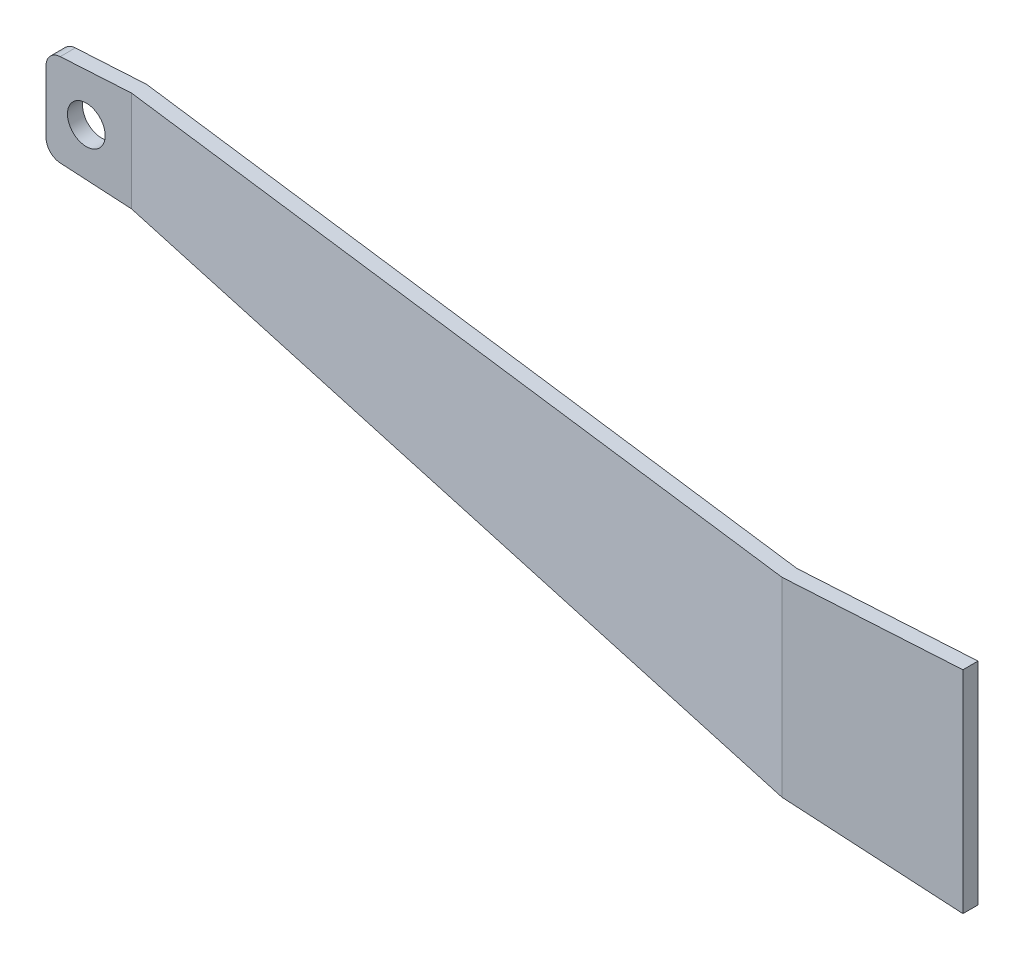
ISO-10303-21;
HEADER;
FILE_DESCRIPTION(('STEP AP214'),'2;1');
FILE_NAME('part.step','',(''),(''),'','','');
FILE_SCHEMA(('AUTOMOTIVE_DESIGN { 1 0 10303 214 1 1 1 1 }'));
ENDSEC;
DATA;
#1=APPLICATION_CONTEXT('core data for automotive mechanical design processes');
#2=APPLICATION_PROTOCOL_DEFINITION('international standard','automotive_design',2000,#1);
#3=PRODUCT_CONTEXT('',#1,'mechanical');
#4=PRODUCT('Part','Part','',(#3));
#5=PRODUCT_RELATED_PRODUCT_CATEGORY('part','',(#4));
#6=PRODUCT_DEFINITION_FORMATION('','',#4);
#7=PRODUCT_DEFINITION_CONTEXT('part definition',#1,'design');
#8=PRODUCT_DEFINITION('design','',#6,#7);
#9=PRODUCT_DEFINITION_SHAPE('','',#8);
#10=(LENGTH_UNIT() NAMED_UNIT(*) SI_UNIT(.MILLI.,.METRE.));
#11=(NAMED_UNIT(*) PLANE_ANGLE_UNIT() SI_UNIT($,.RADIAN.));
#12=(NAMED_UNIT(*) SI_UNIT($,.STERADIAN.) SOLID_ANGLE_UNIT());
#13=UNCERTAINTY_MEASURE_WITH_UNIT(LENGTH_MEASURE(1.E-05),#10,'distance_accuracy_value','');
#14=(GEOMETRIC_REPRESENTATION_CONTEXT(3) GLOBAL_UNCERTAINTY_ASSIGNED_CONTEXT((#13)) GLOBAL_UNIT_ASSIGNED_CONTEXT((#10,
#11,#12)) REPRESENTATION_CONTEXT('',''));
#15=CARTESIAN_POINT('',(0.,0.,0.));
#16=DIRECTION('',(0.,0.,1.));
#17=DIRECTION('',(1.,0.,0.));
#18=AXIS2_PLACEMENT_3D('',#15,#16,#17);
#19=CARTESIAN_POINT('',(389.928307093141,-177.766449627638,-5.72696488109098));
#20=DIRECTION('',(-0.0570497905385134,-0.998371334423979,0.));
#21=DIRECTION('',(0.998371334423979,-0.0570497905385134,0.));
#22=AXIS2_PLACEMENT_3D('',#19,#20,#21);
#23=PLANE('',#22);
#24=DIRECTION('',(-0.998371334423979,0.0570497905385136,0.));
#25=VECTOR('',#24,1.);
#26=CARTESIAN_POINT('',(459.928307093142,-181.766449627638,-4.72696488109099));
#27=LINE('',#26,#25);
#28=CARTESIAN_POINT('',(390.871257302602,-177.82033249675,-4.72696488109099));
#29=VERTEX_POINT('',#28);
#30=CARTESIAN_POINT('',(395.59958891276,-178.090522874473,-4.72696488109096));
#31=VERTEX_POINT('',#30);
#32=EDGE_CURVE('E159',#29,#31,#27,.F.);
#33=ORIENTED_EDGE('',*,*,#32,.F.);
#34=DIRECTION('',(0.,0.,1.));
#35=VECTOR('',#34,1.);
#36=CARTESIAN_POINT('',(390.871257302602,-177.82033249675,-5.72696488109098));
#37=LINE('',#36,#35);
#38=CARTESIAN_POINT('',(390.871257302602,-177.82033249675,-5.72696488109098));
#39=VERTEX_POINT('',#38);
#40=EDGE_CURVE('E59',#29,#39,#37,.F.);
#41=ORIENTED_EDGE('',*,*,#40,.T.);
#42=DIRECTION('',(0.998371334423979,-0.0570497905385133,0.));
#43=VECTOR('',#42,1.);
#44=CARTESIAN_POINT('',(389.928307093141,-177.766449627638,-5.72696488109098));
#45=LINE('',#44,#43);
#46=CARTESIAN_POINT('',(395.599588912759,-178.090522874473,-5.72696488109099));
#47=VERTEX_POINT('',#46);
#48=EDGE_CURVE('E180',#39,#47,#45,.T.);
#49=ORIENTED_EDGE('',*,*,#48,.T.);
#50=DIRECTION('',(-0.983252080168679,0.0561858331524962,-0.173373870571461));
#51=VECTOR('',#50,1.);
#52=CARTESIAN_POINT('',(447.928307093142,-181.080735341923,3.49999999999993));
#53=LINE('',#52,#51);
#54=CARTESIAN_POINT('',(447.928307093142,-181.080735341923,3.49999999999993));
#55=VERTEX_POINT('',#54);
#56=EDGE_CURVE('E135',#55,#47,#53,.T.);
#57=ORIENTED_EDGE('',*,*,#56,.F.);
#58=DIRECTION('',(-0.998371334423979,0.0570497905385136,0.));
#59=VECTOR('',#58,1.);
#60=CARTESIAN_POINT('',(459.928307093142,-181.766449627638,3.49999999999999));
#61=LINE('',#60,#59);
#62=CARTESIAN_POINT('',(459.928307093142,-181.766449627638,3.49999999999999));
#63=VERTEX_POINT('',#62);
#64=EDGE_CURVE('E133',#63,#55,#61,.T.);
#65=ORIENTED_EDGE('',*,*,#64,.F.);
#66=DIRECTION('',(0.,0.,1.));
#67=VECTOR('',#66,1.);
#68=CARTESIAN_POINT('',(459.928307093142,-181.766449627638,-5.72696488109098));
#69=LINE('',#68,#67);
#70=CARTESIAN_POINT('',(459.928307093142,-181.766449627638,4.5));
#71=VERTEX_POINT('',#70);
#72=EDGE_CURVE('E182',#63,#71,#69,.T.);
#73=ORIENTED_EDGE('',*,*,#72,.T.);
#74=DIRECTION('',(0.998371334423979,-0.0570497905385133,0.));
#75=VECTOR('',#74,1.);
#76=CARTESIAN_POINT('',(389.928307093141,-177.766449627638,4.5));
#77=LINE('',#76,#75);
#78=CARTESIAN_POINT('',(447.928307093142,-181.080735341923,4.49999999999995));
#79=VERTEX_POINT('',#78);
#80=EDGE_CURVE('E172',#79,#71,#77,.T.);
#81=ORIENTED_EDGE('',*,*,#80,.F.);
#82=DIRECTION('',(0.983252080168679,-0.0561858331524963,0.173373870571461));
#83=VECTOR('',#82,1.);
#84=CARTESIAN_POINT('',(395.599588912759,-178.090522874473,-4.72696488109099));
#85=LINE('',#84,#83);
#86=EDGE_CURVE('E161',#31,#79,#85,.T.);
#87=ORIENTED_EDGE('',*,*,#86,.F.);
#88=EDGE_LOOP('',(#33,#41,#49,#57,#65,#73,#81,#87));
#89=FACE_BOUND('',#88,.T.);
#90=ADVANCED_FACE('F36',(#89),#23,.T.);
#91=CARTESIAN_POINT('',(459.928307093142,-167.766449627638,-5.72696488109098));
#92=DIRECTION('',(-0.0570497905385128,0.998371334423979,0.));
#93=DIRECTION('',(-0.998371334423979,-0.0570497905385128,0.));
#94=AXIS2_PLACEMENT_3D('',#91,#92,#93);
#95=PLANE('',#94);
#96=DIRECTION('',(-0.998371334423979,-0.0570497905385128,0.));
#97=VECTOR('',#96,1.);
#98=CARTESIAN_POINT('',(459.928307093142,-167.766449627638,-5.72696488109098));
#99=LINE('',#98,#97);
#100=CARTESIAN_POINT('',(395.59958891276,-171.442376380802,-5.72696488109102));
#101=VERTEX_POINT('',#100);
#102=CARTESIAN_POINT('',(390.871257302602,-171.712566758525,-5.72696488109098));
#103=VERTEX_POINT('',#102);
#104=EDGE_CURVE('E175',#101,#103,#99,.T.);
#105=ORIENTED_EDGE('',*,*,#104,.T.);
#106=DIRECTION('',(0.,0.,1.));
#107=VECTOR('',#106,1.);
#108=CARTESIAN_POINT('',(390.871257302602,-171.712566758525,-5.72696488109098));
#109=LINE('',#108,#107);
#110=CARTESIAN_POINT('',(390.871257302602,-171.712566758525,-4.72696488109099));
#111=VERTEX_POINT('',#110);
#112=EDGE_CURVE('E11',#103,#111,#109,.T.);
#113=ORIENTED_EDGE('',*,*,#112,.T.);
#114=DIRECTION('',(-0.998371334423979,-0.0570497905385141,0.));
#115=VECTOR('',#114,1.);
#116=CARTESIAN_POINT('',(395.59958891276,-171.442376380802,-4.72696488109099));
#117=LINE('',#116,#115);
#118=CARTESIAN_POINT('',(395.59958891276,-171.442376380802,-4.72696488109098));
#119=VERTEX_POINT('',#118);
#120=EDGE_CURVE('E150',#119,#111,#117,.T.);
#121=ORIENTED_EDGE('',*,*,#120,.F.);
#122=DIRECTION('',(-0.983252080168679,-0.0561858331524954,-0.173373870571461));
#123=VECTOR('',#122,1.);
#124=CARTESIAN_POINT('',(447.928307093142,-168.452163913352,4.5));
#125=LINE('',#124,#123);
#126=CARTESIAN_POINT('',(447.928307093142,-168.452163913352,4.5));
#127=VERTEX_POINT('',#126);
#128=EDGE_CURVE('E134',#127,#119,#125,.T.);
#129=ORIENTED_EDGE('',*,*,#128,.F.);
#130=DIRECTION('',(-0.998371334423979,-0.0570497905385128,0.));
#131=VECTOR('',#130,1.);
#132=CARTESIAN_POINT('',(459.928307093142,-167.766449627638,4.49999999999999));
#133=LINE('',#132,#131);
#134=CARTESIAN_POINT('',(459.928307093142,-167.766449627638,4.49999999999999));
#135=VERTEX_POINT('',#134);
#136=EDGE_CURVE('E169',#135,#127,#133,.T.);
#137=ORIENTED_EDGE('',*,*,#136,.F.);
#138=DIRECTION('',(0.,0.,1.));
#139=VECTOR('',#138,1.);
#140=CARTESIAN_POINT('',(459.928307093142,-167.766449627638,-5.72696488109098));
#141=LINE('',#140,#139);
#142=CARTESIAN_POINT('',(459.928307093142,-167.766449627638,3.49999999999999));
#143=VERTEX_POINT('',#142);
#144=EDGE_CURVE('E140',#143,#135,#141,.T.);
#145=ORIENTED_EDGE('',*,*,#144,.F.);
#146=DIRECTION('',(0.998371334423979,0.0570497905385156,0.));
#147=VECTOR('',#146,1.);
#148=CARTESIAN_POINT('',(447.928307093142,-168.452163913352,3.5));
#149=LINE('',#148,#147);
#150=CARTESIAN_POINT('',(447.928307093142,-168.452163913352,3.49999999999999));
#151=VERTEX_POINT('',#150);
#152=EDGE_CURVE('E126',#151,#143,#149,.T.);
#153=ORIENTED_EDGE('',*,*,#152,.F.);
#154=DIRECTION('',(0.983252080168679,0.0561858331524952,0.173373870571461));
#155=VECTOR('',#154,1.);
#156=CARTESIAN_POINT('',(395.59958891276,-171.442376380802,-5.72696488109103));
#157=LINE('',#156,#155);
#158=EDGE_CURVE('E116',#101,#151,#157,.T.);
#159=ORIENTED_EDGE('',*,*,#158,.F.);
#160=EDGE_LOOP('',(#105,#113,#121,#129,#137,#145,#153,#159));
#161=FACE_BOUND('',#160,.T.);
#162=ADVANCED_FACE('F138',(#161),#95,.T.);
#163=CARTESIAN_POINT('',(459.928307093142,-181.766449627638,-5.72696488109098));
#164=DIRECTION('',(1.,0.,0.));
#165=DIRECTION('',(0.,0.,-1.));
#166=AXIS2_PLACEMENT_3D('',#163,#164,#165);
#167=PLANE('',#166);
#168=ORIENTED_EDGE('',*,*,#72,.F.);
#169=DIRECTION('',(0.,1.,0.));
#170=VECTOR('',#169,1.);
#171=CARTESIAN_POINT('',(459.928307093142,-181.766449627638,3.5));
#172=LINE('',#171,#170);
#173=EDGE_CURVE('E141',#143,#63,#172,.F.);
#174=ORIENTED_EDGE('',*,*,#173,.F.);
#175=ORIENTED_EDGE('',*,*,#144,.T.);
#176=DIRECTION('',(0.,1.,0.));
#177=VECTOR('',#176,1.);
#178=CARTESIAN_POINT('',(459.928307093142,-181.766449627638,4.5));
#179=LINE('',#178,#177);
#180=EDGE_CURVE('E166',#71,#135,#179,.T.);
#181=ORIENTED_EDGE('',*,*,#180,.F.);
#182=EDGE_LOOP('',(#168,#174,#175,#181));
#183=FACE_BOUND('',#182,.T.);
#184=ADVANCED_FACE('F38',(#183),#167,.T.);
#185=CARTESIAN_POINT('',(459.928307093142,-167.766449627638,-5.72696488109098));
#186=DIRECTION('',(0.,0.,1.));
#187=DIRECTION('',(1.,0.,0.));
#188=AXIS2_PLACEMENT_3D('',#185,#186,#187);
#189=PLANE('',#188);
#190=CARTESIAN_POINT('',(392.59958891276,-174.765522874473,-5.72696488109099));
#191=DIRECTION('',(0.,0.,1.));
#192=DIRECTION('',(0.,-1.,0.));
#193=AXIS2_PLACEMENT_3D('',#190,#191,#192);
#194=CIRCLE('',#193,1.25000000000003);
#195=CARTESIAN_POINT('',(392.59958891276,-176.015522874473,-5.72696488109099));
#196=VERTEX_POINT('',#195);
#197=EDGE_CURVE('E251',#196,#196,#194,.T.);
#198=ORIENTED_EDGE('',*,*,#197,.T.);
#199=EDGE_LOOP('',(#198));
#200=FACE_BOUND('',#199,.T.);
#201=ORIENTED_EDGE('',*,*,#48,.F.);
#202=CARTESIAN_POINT('',(390.928307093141,-176.821961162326,-5.72696488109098));
#203=DIRECTION('',(0.,0.,1.));
#204=DIRECTION('',(1.,0.,0.));
#205=AXIS2_PLACEMENT_3D('',#202,#203,#204);
#206=CIRCLE('',#205,1.);
#207=CARTESIAN_POINT('',(389.928307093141,-176.821961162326,-5.72696488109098));
#208=VERTEX_POINT('',#207);
#209=EDGE_CURVE('E44',#39,#208,#206,.F.);
#210=ORIENTED_EDGE('',*,*,#209,.T.);
#211=DIRECTION('',(0.,-1.,0.));
#212=VECTOR('',#211,1.);
#213=CARTESIAN_POINT('',(389.928307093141,-171.766449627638,-5.72696488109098));
#214=LINE('',#213,#212);
#215=CARTESIAN_POINT('',(389.928307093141,-172.710938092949,-5.72696488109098));
#216=VERTEX_POINT('',#215);
#217=EDGE_CURVE('E177',#216,#208,#214,.T.);
#218=ORIENTED_EDGE('',*,*,#217,.F.);
#219=CARTESIAN_POINT('',(390.928307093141,-172.71093809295,-5.72696488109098));
#220=DIRECTION('',(0.,0.,1.));
#221=DIRECTION('',(1.,0.,0.));
#222=AXIS2_PLACEMENT_3D('',#219,#220,#221);
#223=CIRCLE('',#222,1.);
#224=EDGE_CURVE('E51',#216,#103,#223,.F.);
#225=ORIENTED_EDGE('',*,*,#224,.T.);
#226=ORIENTED_EDGE('',*,*,#104,.F.);
#227=DIRECTION('',(0.,1.,0.));
#228=VECTOR('',#227,1.);
#229=CARTESIAN_POINT('',(395.599588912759,-181.766449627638,-5.72696488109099));
#230=LINE('',#229,#228);
#231=EDGE_CURVE('E123',#101,#47,#230,.F.);
#232=ORIENTED_EDGE('',*,*,#231,.T.);
#233=EDGE_LOOP('',(#201,#210,#218,#225,#226,#232));
#234=FACE_BOUND('',#233,.T.);
#235=ADVANCED_FACE('F196',(#200,#234),#189,.F.);
#236=CARTESIAN_POINT('',(389.928307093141,-171.766449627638,-5.72696488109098));
#237=DIRECTION('',(-1.,0.,0.));
#238=DIRECTION('',(0.,0.,1.));
#239=AXIS2_PLACEMENT_3D('',#236,#237,#238);
#240=PLANE('',#239);
#241=ORIENTED_EDGE('',*,*,#217,.T.);
#242=DIRECTION('',(0.,0.,1.));
#243=VECTOR('',#242,1.);
#244=CARTESIAN_POINT('',(389.928307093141,-176.821961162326,-5.72696488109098));
#245=LINE('',#244,#243);
#246=CARTESIAN_POINT('',(389.928307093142,-176.821961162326,-4.72696488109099));
#247=VERTEX_POINT('',#246);
#248=EDGE_CURVE('E187',#208,#247,#245,.T.);
#249=ORIENTED_EDGE('',*,*,#248,.T.);
#250=DIRECTION('',(0.,-1.,0.));
#251=VECTOR('',#250,1.);
#252=CARTESIAN_POINT('',(389.928307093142,-181.766449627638,-4.72696488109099));
#253=LINE('',#252,#251);
#254=CARTESIAN_POINT('',(389.928307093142,-172.710938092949,-4.72696488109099));
#255=VERTEX_POINT('',#254);
#256=EDGE_CURVE('E153',#255,#247,#253,.T.);
#257=ORIENTED_EDGE('',*,*,#256,.F.);
#258=DIRECTION('',(0.,0.,1.));
#259=VECTOR('',#258,1.);
#260=CARTESIAN_POINT('',(389.928307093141,-172.710938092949,-5.72696488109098));
#261=LINE('',#260,#259);
#262=EDGE_CURVE('E184',#255,#216,#261,.F.);
#263=ORIENTED_EDGE('',*,*,#262,.T.);
#264=EDGE_LOOP('',(#241,#249,#257,#263));
#265=FACE_BOUND('',#264,.T.);
#266=ADVANCED_FACE('F200',(#265),#240,.T.);
#267=CARTESIAN_POINT('',(459.928307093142,-167.766449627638,4.49999999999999));
#268=DIRECTION('',(0.,0.,1.));
#269=DIRECTION('',(1.,0.,0.));
#270=AXIS2_PLACEMENT_3D('',#267,#268,#269);
#271=PLANE('',#270);
#272=ORIENTED_EDGE('',*,*,#136,.T.);
#273=DIRECTION('',(0.,-1.,0.));
#274=VECTOR('',#273,1.);
#275=CARTESIAN_POINT('',(447.928307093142,-181.766449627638,4.49999999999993));
#276=LINE('',#275,#274);
#277=EDGE_CURVE('E156',#127,#79,#276,.T.);
#278=ORIENTED_EDGE('',*,*,#277,.T.);
#279=ORIENTED_EDGE('',*,*,#80,.T.);
#280=ORIENTED_EDGE('',*,*,#180,.T.);
#281=EDGE_LOOP('',(#272,#278,#279,#280));
#282=FACE_BOUND('',#281,.T.);
#283=ADVANCED_FACE('F215',(#282),#271,.T.);
#284=CARTESIAN_POINT('',(395.59958891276,-181.766449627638,-4.72696488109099));
#285=DIRECTION('',(0.,0.,1.));
#286=DIRECTION('',(0.,-1.,0.));
#287=AXIS2_PLACEMENT_3D('',#284,#285,#286);
#288=PLANE('',#287);
#289=CARTESIAN_POINT('',(392.59958891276,-174.765522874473,-4.72696488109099));
#290=DIRECTION('',(0.,0.,1.));
#291=DIRECTION('',(0.,-1.,0.));
#292=AXIS2_PLACEMENT_3D('',#289,#290,#291);
#293=CIRCLE('',#292,1.25000000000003);
#294=CARTESIAN_POINT('',(392.59958891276,-176.015522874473,-4.72696488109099));
#295=VERTEX_POINT('',#294);
#296=EDGE_CURVE('E127',#295,#295,#293,.T.);
#297=ORIENTED_EDGE('',*,*,#296,.F.);
#298=EDGE_LOOP('',(#297));
#299=FACE_BOUND('',#298,.T.);
#300=ORIENTED_EDGE('',*,*,#256,.T.);
#301=CARTESIAN_POINT('',(390.928307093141,-176.821961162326,-4.72696488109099));
#302=DIRECTION('',(0.,0.,1.));
#303=DIRECTION('',(0.,-1.,0.));
#304=AXIS2_PLACEMENT_3D('',#301,#302,#303);
#305=CIRCLE('',#304,1.);
#306=EDGE_CURVE('E192',#247,#29,#305,.T.);
#307=ORIENTED_EDGE('',*,*,#306,.T.);
#308=ORIENTED_EDGE('',*,*,#32,.T.);
#309=DIRECTION('',(0.,1.,0.));
#310=VECTOR('',#309,1.);
#311=CARTESIAN_POINT('',(395.59958891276,-181.766449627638,-4.72696488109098));
#312=LINE('',#311,#310);
#313=EDGE_CURVE('E163',#119,#31,#312,.F.);
#314=ORIENTED_EDGE('',*,*,#313,.F.);
#315=ORIENTED_EDGE('',*,*,#120,.T.);
#316=CARTESIAN_POINT('',(390.928307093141,-172.71093809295,-4.72696488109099));
#317=DIRECTION('',(0.,0.,1.));
#318=DIRECTION('',(0.,-1.,0.));
#319=AXIS2_PLACEMENT_3D('',#316,#317,#318);
#320=CIRCLE('',#319,1.);
#321=EDGE_CURVE('E190',#111,#255,#320,.T.);
#322=ORIENTED_EDGE('',*,*,#321,.T.);
#323=EDGE_LOOP('',(#300,#307,#308,#314,#315,#322));
#324=FACE_BOUND('',#323,.T.);
#325=ADVANCED_FACE('F206',(#299,#324),#288,.T.);
#326=CARTESIAN_POINT('',(447.928307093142,-181.766449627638,4.49999999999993));
#327=DIRECTION('',(-0.173648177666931,0.,0.984807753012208));
#328=DIRECTION('',(0.98480775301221,0.,0.173648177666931));
#329=AXIS2_PLACEMENT_3D('',#326,#327,#328);
#330=PLANE('',#329);
#331=ORIENTED_EDGE('',*,*,#128,.T.);
#332=ORIENTED_EDGE('',*,*,#313,.T.);
#333=ORIENTED_EDGE('',*,*,#86,.T.);
#334=ORIENTED_EDGE('',*,*,#277,.F.);
#335=EDGE_LOOP('',(#331,#332,#333,#334));
#336=FACE_BOUND('',#335,.T.);
#337=ADVANCED_FACE('F212',(#336),#330,.T.);
#338=CARTESIAN_POINT('',(447.928307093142,-181.766449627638,3.49999999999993));
#339=DIRECTION('',(0.,0.,-1.));
#340=DIRECTION('',(-1.,0.,0.));
#341=AXIS2_PLACEMENT_3D('',#338,#339,#340);
#342=PLANE('',#341);
#343=ORIENTED_EDGE('',*,*,#152,.T.);
#344=ORIENTED_EDGE('',*,*,#173,.T.);
#345=ORIENTED_EDGE('',*,*,#64,.T.);
#346=DIRECTION('',(0.,1.,0.));
#347=VECTOR('',#346,1.);
#348=CARTESIAN_POINT('',(447.928307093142,-181.766449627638,3.49999999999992));
#349=LINE('',#348,#347);
#350=EDGE_CURVE('E120',#151,#55,#349,.F.);
#351=ORIENTED_EDGE('',*,*,#350,.F.);
#352=EDGE_LOOP('',(#343,#344,#345,#351));
#353=FACE_BOUND('',#352,.T.);
#354=ADVANCED_FACE('F130',(#353),#342,.T.);
#355=CARTESIAN_POINT('',(395.599588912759,-181.766449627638,-5.72696488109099));
#356=DIRECTION('',(0.173648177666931,0.,-0.984807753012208));
#357=DIRECTION('',(-0.98480775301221,0.,-0.173648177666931));
#358=AXIS2_PLACEMENT_3D('',#355,#356,#357);
#359=PLANE('',#358);
#360=ORIENTED_EDGE('',*,*,#158,.T.);
#361=ORIENTED_EDGE('',*,*,#350,.T.);
#362=ORIENTED_EDGE('',*,*,#56,.T.);
#363=ORIENTED_EDGE('',*,*,#231,.F.);
#364=EDGE_LOOP('',(#360,#361,#362,#363));
#365=FACE_BOUND('',#364,.T.);
#366=ADVANCED_FACE('F118',(#365),#359,.T.);
#367=CARTESIAN_POINT('',(390.928307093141,-176.821961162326,-5.72696488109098));
#368=DIRECTION('',(0.,0.,1.));
#369=DIRECTION('',(1.,0.,0.));
#370=AXIS2_PLACEMENT_3D('',#367,#368,#369);
#371=CYLINDRICAL_SURFACE('',#370,1.);
#372=ORIENTED_EDGE('',*,*,#209,.F.);
#373=ORIENTED_EDGE('',*,*,#40,.F.);
#374=ORIENTED_EDGE('',*,*,#306,.F.);
#375=ORIENTED_EDGE('',*,*,#248,.F.);
#376=EDGE_LOOP('',(#372,#373,#374,#375));
#377=FACE_BOUND('',#376,.T.);
#378=ADVANCED_FACE('F203',(#377),#371,.T.);
#379=CARTESIAN_POINT('',(390.928307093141,-172.71093809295,-5.72696488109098));
#380=DIRECTION('',(0.,0.,1.));
#381=DIRECTION('',(1.,0.,0.));
#382=AXIS2_PLACEMENT_3D('',#379,#380,#381);
#383=CYLINDRICAL_SURFACE('',#382,1.);
#384=ORIENTED_EDGE('',*,*,#224,.F.);
#385=ORIENTED_EDGE('',*,*,#262,.F.);
#386=ORIENTED_EDGE('',*,*,#321,.F.);
#387=ORIENTED_EDGE('',*,*,#112,.F.);
#388=EDGE_LOOP('',(#384,#385,#386,#387));
#389=FACE_BOUND('',#388,.T.);
#390=ADVANCED_FACE('F220',(#389),#383,.T.);
#391=CARTESIAN_POINT('',(392.59958891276,-174.765522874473,-4.72696488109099));
#392=DIRECTION('',(0.,0.,1.));
#393=DIRECTION('',(0.,-1.,0.));
#394=AXIS2_PLACEMENT_3D('',#391,#392,#393);
#395=CYLINDRICAL_SURFACE('',#394,1.25000000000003);
#396=ORIENTED_EDGE('',*,*,#197,.F.);
#397=EDGE_LOOP('',(#396));
#398=FACE_BOUND('',#397,.T.);
#399=ORIENTED_EDGE('',*,*,#296,.T.);
#400=EDGE_LOOP('',(#399));
#401=FACE_BOUND('',#400,.T.);
#402=ADVANCED_FACE('F222',(#398,#401),#395,.F.);
#403=CLOSED_SHELL('',(#90,#162,#184,#235,#266,#283,#325,#337,#354,#366,#378,#390,#402));
#404=MANIFOLD_SOLID_BREP('B2',#403);
#405=ADVANCED_BREP_SHAPE_REPRESENTATION('',(#18,#404),#14);
#406=SHAPE_DEFINITION_REPRESENTATION(#9,#405);
ENDSEC;
END-ISO-10303-21;
